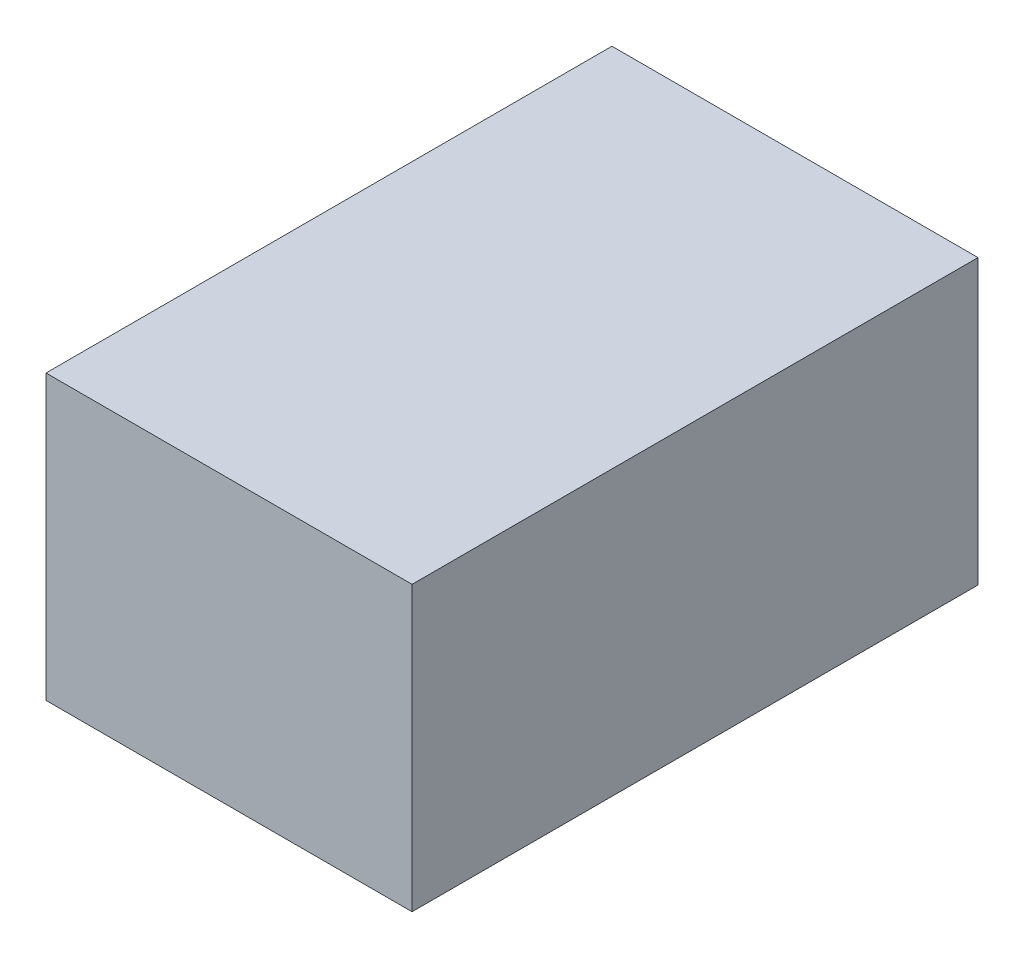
ISO-10303-21;
HEADER;
FILE_DESCRIPTION(('STEP AP214'),'2;1');
FILE_NAME('part.step','',(''),(''),'','','');
FILE_SCHEMA(('AUTOMOTIVE_DESIGN { 1 0 10303 214 1 1 1 1 }'));
ENDSEC;
DATA;
#1=APPLICATION_CONTEXT('core data for automotive mechanical design processes');
#2=APPLICATION_PROTOCOL_DEFINITION('international standard','automotive_design',2000,#1);
#3=PRODUCT_CONTEXT('',#1,'mechanical');
#4=PRODUCT('Part','Part','',(#3));
#5=PRODUCT_RELATED_PRODUCT_CATEGORY('part','',(#4));
#6=PRODUCT_DEFINITION_FORMATION('','',#4);
#7=PRODUCT_DEFINITION_CONTEXT('part definition',#1,'design');
#8=PRODUCT_DEFINITION('design','',#6,#7);
#9=PRODUCT_DEFINITION_SHAPE('','',#8);
#10=(LENGTH_UNIT() NAMED_UNIT(*) SI_UNIT(.MILLI.,.METRE.));
#11=(NAMED_UNIT(*) PLANE_ANGLE_UNIT() SI_UNIT($,.RADIAN.));
#12=(NAMED_UNIT(*) SI_UNIT($,.STERADIAN.) SOLID_ANGLE_UNIT());
#13=UNCERTAINTY_MEASURE_WITH_UNIT(LENGTH_MEASURE(1.E-05),#10,'distance_accuracy_value','');
#14=(GEOMETRIC_REPRESENTATION_CONTEXT(3) GLOBAL_UNCERTAINTY_ASSIGNED_CONTEXT((#13)) GLOBAL_UNIT_ASSIGNED_CONTEXT((#10,
#11,#12)) REPRESENTATION_CONTEXT('',''));
#15=CARTESIAN_POINT('',(0.,0.,0.));
#16=DIRECTION('',(0.,0.,1.));
#17=DIRECTION('',(1.,0.,0.));
#18=AXIS2_PLACEMENT_3D('',#15,#16,#17);
#19=CARTESIAN_POINT('',(0.0436376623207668,-2.49999999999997,-154.956362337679));
#20=DIRECTION('',(0.,-1.,0.));
#21=DIRECTION('',(0.,0.,-1.));
#22=AXIS2_PLACEMENT_3D('',#19,#20,#21);
#23=PLANE('',#22);
#24=DIRECTION('',(1.,0.,0.));
#25=VECTOR('',#24,1.);
#26=CARTESIAN_POINT('',(0.0436376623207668,-2.49999999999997,-154.956362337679));
#27=LINE('',#26,#25);
#28=CARTESIAN_POINT('',(-100.153997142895,-2.49999999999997,-154.956362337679));
#29=VERTEX_POINT('',#28);
#30=CARTESIAN_POINT('',(100.241272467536,-2.49999999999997,-154.956362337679));
#31=VERTEX_POINT('',#30);
#32=EDGE_CURVE('E68',#29,#31,#27,.T.);
#33=ORIENTED_EDGE('',*,*,#32,.T.);
#34=DIRECTION('',(0.,0.,-1.));
#35=VECTOR('',#34,1.);
#36=CARTESIAN_POINT('',(100.241272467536,-2.49999999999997,-154.956362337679));
#37=LINE('',#36,#35);
#38=CARTESIAN_POINT('',(100.241272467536,-2.49999999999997,154.869087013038));
#39=VERTEX_POINT('',#38);
#40=EDGE_CURVE('E55',#39,#31,#37,.T.);
#41=ORIENTED_EDGE('',*,*,#40,.F.);
#42=DIRECTION('',(1.,0.,0.));
#43=VECTOR('',#42,1.);
#44=CARTESIAN_POINT('',(0.0436376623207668,-2.49999999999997,154.869087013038));
#45=LINE('',#44,#43);
#46=CARTESIAN_POINT('',(-100.153997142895,-2.49999999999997,154.869087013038));
#47=VERTEX_POINT('',#46);
#48=EDGE_CURVE('E20',#47,#39,#45,.T.);
#49=ORIENTED_EDGE('',*,*,#48,.F.);
#50=DIRECTION('',(0.,0.,1.));
#51=VECTOR('',#50,1.);
#52=CARTESIAN_POINT('',(-100.153997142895,-2.49999999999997,-154.956362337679));
#53=LINE('',#52,#51);
#54=EDGE_CURVE('E81',#29,#47,#53,.T.);
#55=ORIENTED_EDGE('',*,*,#54,.F.);
#56=EDGE_LOOP('',(#33,#41,#49,#55));
#57=FACE_BOUND('',#56,.T.);
#58=ADVANCED_FACE('F17',(#57),#23,.T.);
#59=CARTESIAN_POINT('',(0.0436376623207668,75.1213654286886,154.869087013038));
#60=DIRECTION('',(0.,0.,1.));
#61=DIRECTION('',(1.,0.,0.));
#62=AXIS2_PLACEMENT_3D('',#59,#60,#61);
#63=PLANE('',#62);
#64=DIRECTION('',(0.,1.,0.));
#65=VECTOR('',#64,1.);
#66=CARTESIAN_POINT('',(100.241272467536,75.1213654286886,154.869087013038));
#67=LINE('',#66,#65);
#68=CARTESIAN_POINT('',(100.241272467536,152.742730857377,154.869087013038));
#69=VERTEX_POINT('',#68);
#70=EDGE_CURVE('E61',#69,#39,#67,.F.);
#71=ORIENTED_EDGE('',*,*,#70,.F.);
#72=DIRECTION('',(1.,0.,0.));
#73=VECTOR('',#72,1.);
#74=CARTESIAN_POINT('',(0.0436376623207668,152.742730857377,154.869087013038));
#75=LINE('',#74,#73);
#76=CARTESIAN_POINT('',(-100.153997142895,152.742730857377,154.869087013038));
#77=VERTEX_POINT('',#76);
#78=EDGE_CURVE('E83',#77,#69,#75,.T.);
#79=ORIENTED_EDGE('',*,*,#78,.F.);
#80=DIRECTION('',(0.,1.,0.));
#81=VECTOR('',#80,1.);
#82=CARTESIAN_POINT('',(-100.153997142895,75.1213654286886,154.869087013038));
#83=LINE('',#82,#81);
#84=EDGE_CURVE('E64',#47,#77,#83,.T.);
#85=ORIENTED_EDGE('',*,*,#84,.F.);
#86=ORIENTED_EDGE('',*,*,#48,.T.);
#87=EDGE_LOOP('',(#71,#79,#85,#86));
#88=FACE_BOUND('',#87,.T.);
#89=ADVANCED_FACE('F60',(#88),#63,.T.);
#90=CARTESIAN_POINT('',(100.241272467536,75.1213654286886,-154.956362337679));
#91=DIRECTION('',(1.,0.,0.));
#92=DIRECTION('',(0.,0.,-1.));
#93=AXIS2_PLACEMENT_3D('',#90,#91,#92);
#94=PLANE('',#93);
#95=DIRECTION('',(0.,1.,0.));
#96=VECTOR('',#95,1.);
#97=CARTESIAN_POINT('',(100.241272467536,75.1213654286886,-154.956362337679));
#98=LINE('',#97,#96);
#99=CARTESIAN_POINT('',(100.241272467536,152.742730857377,-154.956362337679));
#100=VERTEX_POINT('',#99);
#101=EDGE_CURVE('E70',#31,#100,#98,.T.);
#102=ORIENTED_EDGE('',*,*,#101,.T.);
#103=DIRECTION('',(0.,0.,1.));
#104=VECTOR('',#103,1.);
#105=CARTESIAN_POINT('',(100.241272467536,152.742730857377,-154.956362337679));
#106=LINE('',#105,#104);
#107=EDGE_CURVE('E74',#69,#100,#106,.F.);
#108=ORIENTED_EDGE('',*,*,#107,.F.);
#109=ORIENTED_EDGE('',*,*,#70,.T.);
#110=ORIENTED_EDGE('',*,*,#40,.T.);
#111=EDGE_LOOP('',(#102,#108,#109,#110));
#112=FACE_BOUND('',#111,.T.);
#113=ADVANCED_FACE('F72',(#112),#94,.T.);
#114=CARTESIAN_POINT('',(0.0436376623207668,75.1213654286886,-154.956362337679));
#115=DIRECTION('',(0.,0.,1.));
#116=DIRECTION('',(1.,0.,0.));
#117=AXIS2_PLACEMENT_3D('',#114,#115,#116);
#118=PLANE('',#117);
#119=DIRECTION('',(0.,1.,0.));
#120=VECTOR('',#119,1.);
#121=CARTESIAN_POINT('',(-100.153997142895,75.1213654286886,-154.956362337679));
#122=LINE('',#121,#120);
#123=CARTESIAN_POINT('',(-100.153997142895,152.742730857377,-154.956362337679));
#124=VERTEX_POINT('',#123);
#125=EDGE_CURVE('E35',#124,#29,#122,.F.);
#126=ORIENTED_EDGE('',*,*,#125,.F.);
#127=DIRECTION('',(1.,0.,0.));
#128=VECTOR('',#127,1.);
#129=CARTESIAN_POINT('',(0.0436376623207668,152.742730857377,-154.956362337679));
#130=LINE('',#129,#128);
#131=EDGE_CURVE('E26',#100,#124,#130,.F.);
#132=ORIENTED_EDGE('',*,*,#131,.F.);
#133=ORIENTED_EDGE('',*,*,#101,.F.);
#134=ORIENTED_EDGE('',*,*,#32,.F.);
#135=EDGE_LOOP('',(#126,#132,#133,#134));
#136=FACE_BOUND('',#135,.T.);
#137=ADVANCED_FACE('F89',(#136),#118,.F.);
#138=CARTESIAN_POINT('',(-100.153997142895,75.1213654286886,-154.956362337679));
#139=DIRECTION('',(-1.,0.,0.));
#140=DIRECTION('',(0.,0.,1.));
#141=AXIS2_PLACEMENT_3D('',#138,#139,#140);
#142=PLANE('',#141);
#143=ORIENTED_EDGE('',*,*,#125,.T.);
#144=ORIENTED_EDGE('',*,*,#54,.T.);
#145=ORIENTED_EDGE('',*,*,#84,.T.);
#146=DIRECTION('',(0.,0.,1.));
#147=VECTOR('',#146,1.);
#148=CARTESIAN_POINT('',(-100.153997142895,152.742730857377,-154.956362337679));
#149=LINE('',#148,#147);
#150=EDGE_CURVE('E11',#124,#77,#149,.T.);
#151=ORIENTED_EDGE('',*,*,#150,.F.);
#152=EDGE_LOOP('',(#143,#144,#145,#151));
#153=FACE_BOUND('',#152,.T.);
#154=ADVANCED_FACE('F91',(#153),#142,.T.);
#155=CARTESIAN_POINT('',(0.0436376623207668,152.742730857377,-154.956362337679));
#156=DIRECTION('',(0.,1.,0.));
#157=DIRECTION('',(0.,0.,1.));
#158=AXIS2_PLACEMENT_3D('',#155,#156,#157);
#159=PLANE('',#158);
#160=ORIENTED_EDGE('',*,*,#131,.T.);
#161=ORIENTED_EDGE('',*,*,#150,.T.);
#162=ORIENTED_EDGE('',*,*,#78,.T.);
#163=ORIENTED_EDGE('',*,*,#107,.T.);
#164=EDGE_LOOP('',(#160,#161,#162,#163));
#165=FACE_BOUND('',#164,.T.);
#166=ADVANCED_FACE('F88',(#165),#159,.T.);
#167=CLOSED_SHELL('',(#58,#89,#113,#137,#154,#166));
#168=MANIFOLD_SOLID_BREP('B1',#167);
#169=ADVANCED_BREP_SHAPE_REPRESENTATION('',(#18,#168),#14);
#170=SHAPE_DEFINITION_REPRESENTATION(#9,#169);
ENDSEC;
END-ISO-10303-21;
